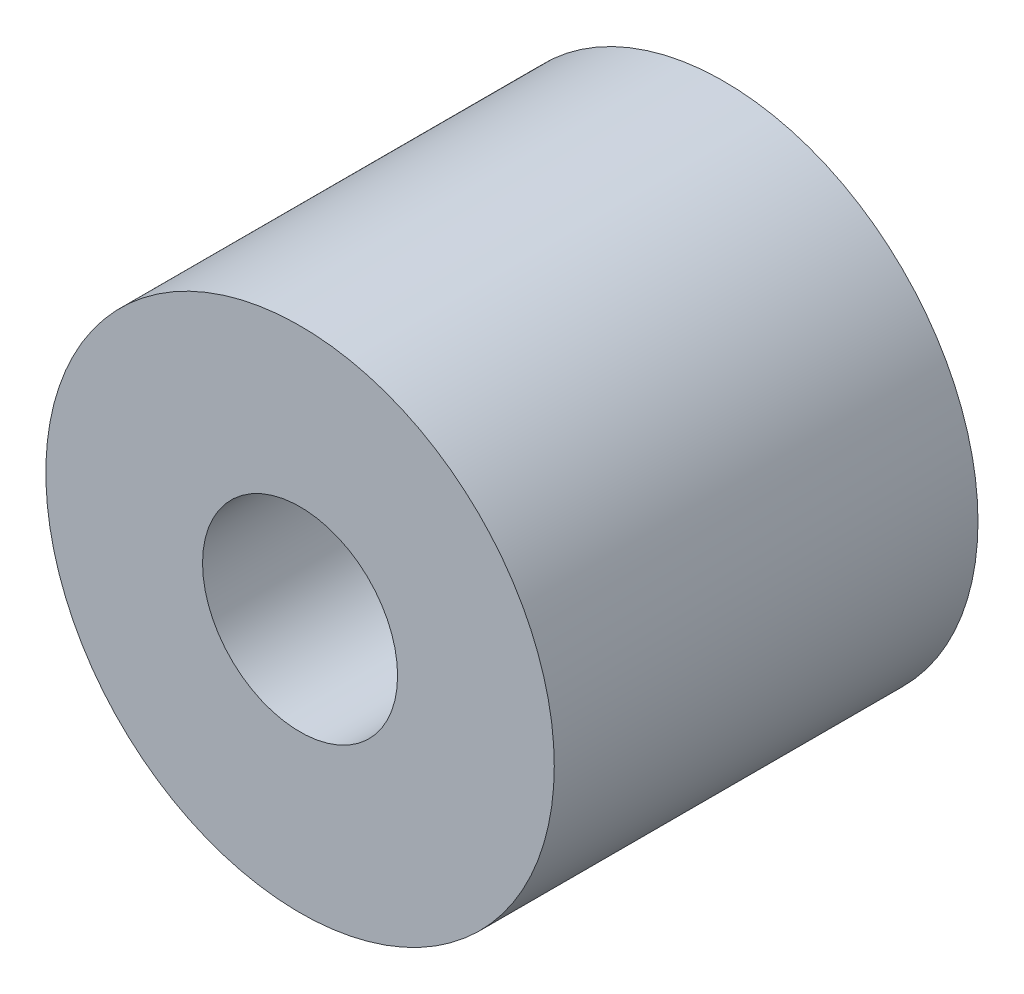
ISO-10303-21;
HEADER;
FILE_DESCRIPTION(('STEP AP214'),'2;1');
FILE_NAME('part.step','',(''),(''),'','','');
FILE_SCHEMA(('AUTOMOTIVE_DESIGN { 1 0 10303 214 1 1 1 1 }'));
ENDSEC;
DATA;
#1=APPLICATION_CONTEXT('core data for automotive mechanical design processes');
#2=APPLICATION_PROTOCOL_DEFINITION('international standard','automotive_design',2000,#1);
#3=PRODUCT_CONTEXT('',#1,'mechanical');
#4=PRODUCT('Part','Part','',(#3));
#5=PRODUCT_RELATED_PRODUCT_CATEGORY('part','',(#4));
#6=PRODUCT_DEFINITION_FORMATION('','',#4);
#7=PRODUCT_DEFINITION_CONTEXT('part definition',#1,'design');
#8=PRODUCT_DEFINITION('design','',#6,#7);
#9=PRODUCT_DEFINITION_SHAPE('','',#8);
#10=(LENGTH_UNIT() NAMED_UNIT(*) SI_UNIT(.MILLI.,.METRE.));
#11=(NAMED_UNIT(*) PLANE_ANGLE_UNIT() SI_UNIT($,.RADIAN.));
#12=(NAMED_UNIT(*) SI_UNIT($,.STERADIAN.) SOLID_ANGLE_UNIT());
#13=UNCERTAINTY_MEASURE_WITH_UNIT(LENGTH_MEASURE(1.E-05),#10,'distance_accuracy_value','');
#14=(GEOMETRIC_REPRESENTATION_CONTEXT(3) GLOBAL_UNCERTAINTY_ASSIGNED_CONTEXT((#13)) GLOBAL_UNIT_ASSIGNED_CONTEXT((#10,
#11,#12)) REPRESENTATION_CONTEXT('',''));
#15=CARTESIAN_POINT('',(0.,0.,0.));
#16=DIRECTION('',(0.,0.,1.));
#17=DIRECTION('',(1.,0.,0.));
#18=AXIS2_PLACEMENT_3D('',#15,#16,#17);
#19=CARTESIAN_POINT('',(0.,0.,25.));
#20=DIRECTION('',(0.,0.,-1.));
#21=DIRECTION('',(-1.,0.,0.));
#22=AXIS2_PLACEMENT_3D('',#19,#20,#21);
#23=CYLINDRICAL_SURFACE('',#22,15.);
#24=CARTESIAN_POINT('',(0.,0.,25.));
#25=DIRECTION('',(0.,0.,1.));
#26=DIRECTION('',(1.,0.,0.));
#27=AXIS2_PLACEMENT_3D('',#24,#25,#26);
#28=CIRCLE('',#27,15.);
#29=CARTESIAN_POINT('',(15.,0.,25.));
#30=VERTEX_POINT('',#29);
#31=EDGE_CURVE('E10',#30,#30,#28,.T.);
#32=ORIENTED_EDGE('',*,*,#31,.F.);
#33=EDGE_LOOP('',(#32));
#34=FACE_BOUND('',#33,.T.);
#35=CARTESIAN_POINT('',(0.,0.,0.));
#36=DIRECTION('',(0.,0.,1.));
#37=DIRECTION('',(1.,0.,0.));
#38=AXIS2_PLACEMENT_3D('',#35,#36,#37);
#39=CIRCLE('',#38,15.);
#40=CARTESIAN_POINT('',(15.,0.,0.));
#41=VERTEX_POINT('',#40);
#42=EDGE_CURVE('E35',#41,#41,#39,.T.);
#43=ORIENTED_EDGE('',*,*,#42,.T.);
#44=EDGE_LOOP('',(#43));
#45=FACE_BOUND('',#44,.T.);
#46=ADVANCED_FACE('F29',(#34,#45),#23,.T.);
#47=CARTESIAN_POINT('',(0.,0.,25.));
#48=DIRECTION('',(0.,0.,1.));
#49=DIRECTION('',(1.,0.,0.));
#50=AXIS2_PLACEMENT_3D('',#47,#48,#49);
#51=PLANE('',#50);
#52=CARTESIAN_POINT('',(0.,0.,25.));
#53=DIRECTION('',(0.,0.,1.));
#54=DIRECTION('',(1.,0.,0.));
#55=AXIS2_PLACEMENT_3D('',#52,#53,#54);
#56=CIRCLE('',#55,5.75436999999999);
#57=CARTESIAN_POINT('',(5.75436999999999,0.,25.));
#58=VERTEX_POINT('',#57);
#59=EDGE_CURVE('E39',#58,#58,#56,.T.);
#60=ORIENTED_EDGE('',*,*,#59,.F.);
#61=EDGE_LOOP('',(#60));
#62=FACE_BOUND('',#61,.T.);
#63=ORIENTED_EDGE('',*,*,#31,.T.);
#64=EDGE_LOOP('',(#63));
#65=FACE_BOUND('',#64,.T.);
#66=ADVANCED_FACE('F58',(#62,#65),#51,.T.);
#67=CARTESIAN_POINT('',(0.,0.,0.));
#68=DIRECTION('',(0.,0.,1.));
#69=DIRECTION('',(1.,0.,0.));
#70=AXIS2_PLACEMENT_3D('',#67,#68,#69);
#71=PLANE('',#70);
#72=CARTESIAN_POINT('',(0.,0.,0.));
#73=DIRECTION('',(0.,0.,1.));
#74=DIRECTION('',(1.,0.,0.));
#75=AXIS2_PLACEMENT_3D('',#72,#73,#74);
#76=CIRCLE('',#75,5.75436999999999);
#77=CARTESIAN_POINT('',(5.75436999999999,0.,0.));
#78=VERTEX_POINT('',#77);
#79=EDGE_CURVE('E43',#78,#78,#76,.T.);
#80=ORIENTED_EDGE('',*,*,#79,.T.);
#81=EDGE_LOOP('',(#80));
#82=FACE_BOUND('',#81,.T.);
#83=ORIENTED_EDGE('',*,*,#42,.F.);
#84=EDGE_LOOP('',(#83));
#85=FACE_BOUND('',#84,.T.);
#86=ADVANCED_FACE('F49',(#82,#85),#71,.F.);
#87=CARTESIAN_POINT('',(0.,0.,25.));
#88=DIRECTION('',(0.,0.,1.));
#89=DIRECTION('',(1.,0.,0.));
#90=AXIS2_PLACEMENT_3D('',#87,#88,#89);
#91=CYLINDRICAL_SURFACE('',#90,5.75436999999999);
#92=ORIENTED_EDGE('',*,*,#79,.F.);
#93=EDGE_LOOP('',(#92));
#94=FACE_BOUND('',#93,.T.);
#95=ORIENTED_EDGE('',*,*,#59,.T.);
#96=EDGE_LOOP('',(#95));
#97=FACE_BOUND('',#96,.T.);
#98=ADVANCED_FACE('F52',(#94,#97),#91,.F.);
#99=CLOSED_SHELL('',(#46,#66,#86,#98));
#100=MANIFOLD_SOLID_BREP('B2',#99);
#101=ADVANCED_BREP_SHAPE_REPRESENTATION('',(#18,#100),#14);
#102=SHAPE_DEFINITION_REPRESENTATION(#9,#101);
ENDSEC;
END-ISO-10303-21;
